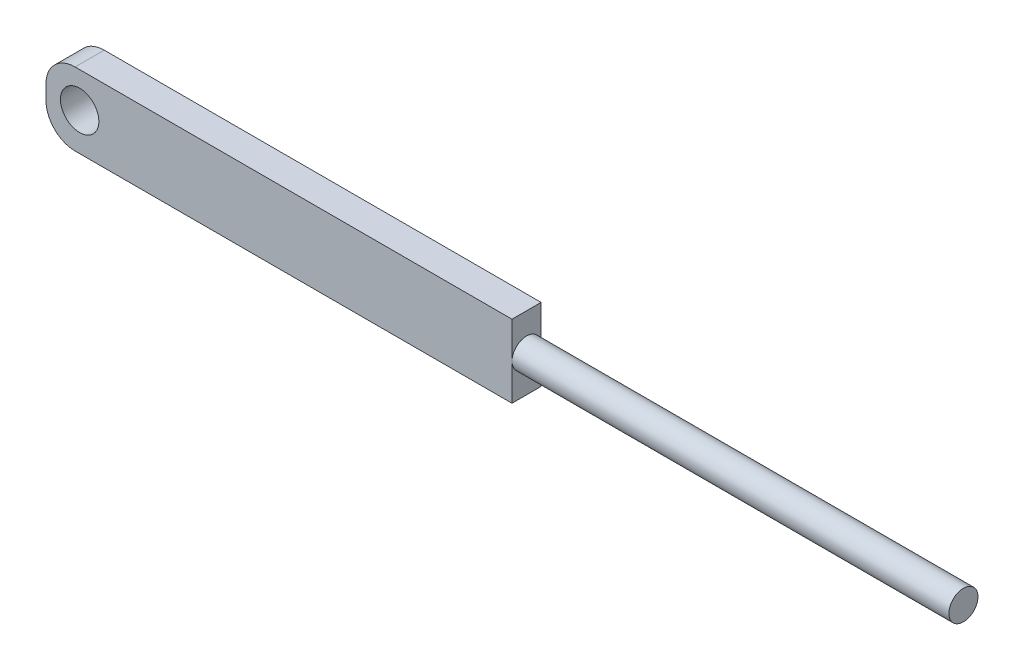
from build123d import *

# Parameters (mm, degrees)
BOSS_EXTRUDE1_DEPTH = 10
SKETCH2_R           = 5
BOSS_EXTRUDE2_DEPTH = 150
SKETCH3_R           = 6.59661228
CUT_EXTRUDE1_DEPTH  = 10


with BuildPart() as part:
    # Sketch1 → Boss-Extrude1 (new body)
    with BuildSketch(Plane.XY):
        with BuildLine():
            Line((10, 0), (160, 0))
            Line((160, 0), (160, 25))
            Line((160, 25), (10, 25))
            ThreePointArc((10, 25), (2.928932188, 22.071067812), (0, 15))
            Line((0, 15), (0, 10))
            ThreePointArc((0, 10), (2.928932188, 2.928932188), (10, 0))
        make_face()
    extrude(amount=BOSS_EXTRUDE1_DEPTH)

    # Sketch2 → Boss-Extrude2 (add)
    with BuildSketch(Plane(origin=(160, 0, 0), x_dir=(0, 0, -1), z_dir=(1, 0, 0))):
        with Locations((-5, 12.5)):
            Circle(SKETCH2_R)
    extrude(amount=BOSS_EXTRUDE2_DEPTH)

    # Sketch3 → Cut-Extrude1 (cut)
    with BuildSketch(Plane.XY.offset(10)):
        with Locations((11.550606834, 12.86647846)):
            Circle(SKETCH3_R)
    extrude(amount=-CUT_EXTRUDE1_DEPTH, mode=Mode.SUBTRACT)


solid = part.part
